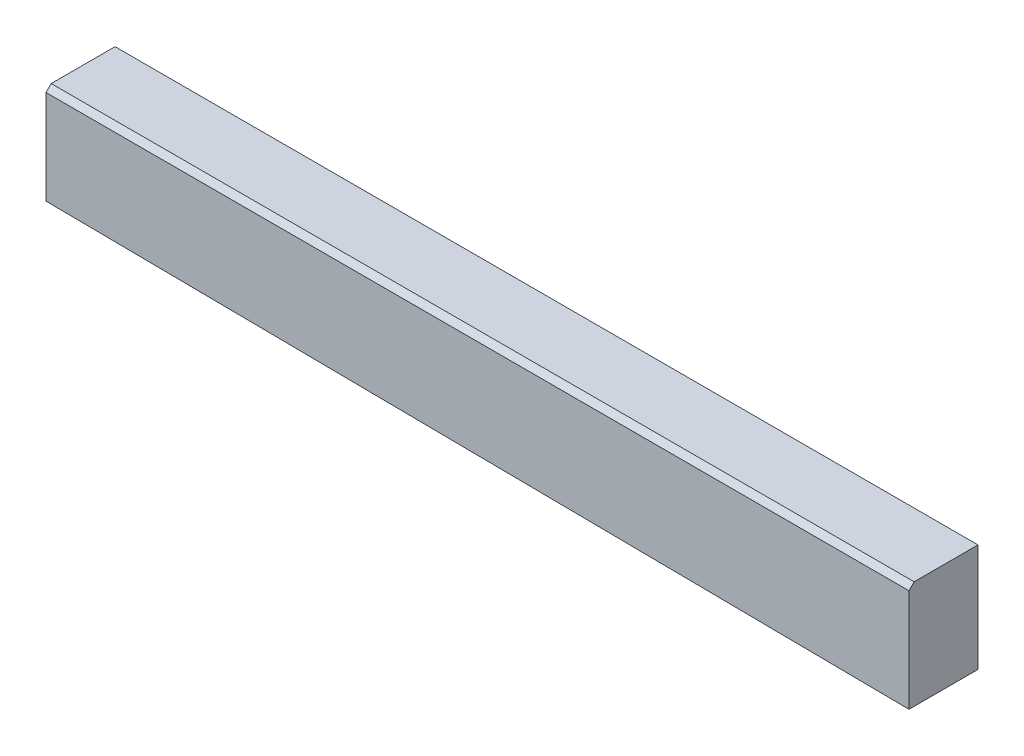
ISO-10303-21;
HEADER;
FILE_DESCRIPTION(('STEP AP214'),'2;1');
FILE_NAME('part.step','',(''),(''),'','','');
FILE_SCHEMA(('AUTOMOTIVE_DESIGN { 1 0 10303 214 1 1 1 1 }'));
ENDSEC;
DATA;
#1=APPLICATION_CONTEXT('core data for automotive mechanical design processes');
#2=APPLICATION_PROTOCOL_DEFINITION('international standard','automotive_design',2000,#1);
#3=PRODUCT_CONTEXT('',#1,'mechanical');
#4=PRODUCT('Part','Part','',(#3));
#5=PRODUCT_RELATED_PRODUCT_CATEGORY('part','',(#4));
#6=PRODUCT_DEFINITION_FORMATION('','',#4);
#7=PRODUCT_DEFINITION_CONTEXT('part definition',#1,'design');
#8=PRODUCT_DEFINITION('design','',#6,#7);
#9=PRODUCT_DEFINITION_SHAPE('','',#8);
#10=(LENGTH_UNIT() NAMED_UNIT(*) SI_UNIT(.MILLI.,.METRE.));
#11=(NAMED_UNIT(*) PLANE_ANGLE_UNIT() SI_UNIT($,.RADIAN.));
#12=(NAMED_UNIT(*) SI_UNIT($,.STERADIAN.) SOLID_ANGLE_UNIT());
#13=UNCERTAINTY_MEASURE_WITH_UNIT(LENGTH_MEASURE(1.E-05),#10,'distance_accuracy_value','');
#14=(GEOMETRIC_REPRESENTATION_CONTEXT(3) GLOBAL_UNCERTAINTY_ASSIGNED_CONTEXT((#13)) GLOBAL_UNIT_ASSIGNED_CONTEXT((#10,
#11,#12)) REPRESENTATION_CONTEXT('',''));
#15=CARTESIAN_POINT('',(0.,0.,0.));
#16=DIRECTION('',(0.,0.,1.));
#17=DIRECTION('',(1.,0.,0.));
#18=AXIS2_PLACEMENT_3D('',#15,#16,#17);
#19=CARTESIAN_POINT('',(0.,24.,4.));
#20=DIRECTION('',(1.,0.,0.));
#21=DIRECTION('',(0.,0.,-1.));
#22=AXIS2_PLACEMENT_3D('',#19,#20,#21);
#23=PLANE('',#22);
#24=DIRECTION('',(0.,0.,-1.));
#25=VECTOR('',#24,1.);
#26=CARTESIAN_POINT('',(0.,24.,4.));
#27=LINE('',#26,#25);
#28=CARTESIAN_POINT('',(0.,24.,3.39999999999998));
#29=VERTEX_POINT('',#28);
#30=CARTESIAN_POINT('',(0.,24.,-4.));
#31=VERTEX_POINT('',#30);
#32=EDGE_CURVE('E106',#29,#31,#27,.T.);
#33=ORIENTED_EDGE('',*,*,#32,.F.);
#34=DIRECTION('',(0.,0.707106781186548,-0.707106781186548));
#35=VECTOR('',#34,1.);
#36=CARTESIAN_POINT('',(0.,23.7,3.69999999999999));
#37=LINE('',#36,#35);
#38=CARTESIAN_POINT('',(0.,23.4,4.));
#39=VERTEX_POINT('',#38);
#40=EDGE_CURVE('E55',#29,#39,#37,.F.);
#41=ORIENTED_EDGE('',*,*,#40,.T.);
#42=DIRECTION('',(0.,-1.,0.));
#43=VECTOR('',#42,1.);
#44=CARTESIAN_POINT('',(0.,24.,4.));
#45=LINE('',#44,#43);
#46=CARTESIAN_POINT('',(0.,11.499983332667,4.));
#47=VERTEX_POINT('',#46);
#48=EDGE_CURVE('E76',#39,#47,#45,.T.);
#49=ORIENTED_EDGE('',*,*,#48,.T.);
#50=DIRECTION('',(0.,0.,-1.));
#51=VECTOR('',#50,1.);
#52=CARTESIAN_POINT('',(0.,11.499983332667,4.));
#53=LINE('',#52,#51);
#54=CARTESIAN_POINT('',(0.,11.499983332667,-4.));
#55=VERTEX_POINT('',#54);
#56=EDGE_CURVE('E79',#47,#55,#53,.T.);
#57=ORIENTED_EDGE('',*,*,#56,.T.);
#58=DIRECTION('',(0.,-1.,0.));
#59=VECTOR('',#58,1.);
#60=CARTESIAN_POINT('',(0.,24.,-4.));
#61=LINE('',#60,#59);
#62=EDGE_CURVE('E98',#31,#55,#61,.T.);
#63=ORIENTED_EDGE('',*,*,#62,.F.);
#64=EDGE_LOOP('',(#33,#41,#49,#57,#63));
#65=FACE_BOUND('',#64,.T.);
#66=ADVANCED_FACE('F33',(#65),#23,.T.);
#67=CARTESIAN_POINT('',(-100.,24.,4.));
#68=DIRECTION('',(0.,1.,0.));
#69=DIRECTION('',(0.,0.,1.));
#70=AXIS2_PLACEMENT_3D('',#67,#68,#69);
#71=PLANE('',#70);
#72=DIRECTION('',(0.,0.,-1.));
#73=VECTOR('',#72,1.);
#74=CARTESIAN_POINT('',(-100.,24.,4.));
#75=LINE('',#74,#73);
#76=CARTESIAN_POINT('',(-100.,24.,3.39999999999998));
#77=VERTEX_POINT('',#76);
#78=CARTESIAN_POINT('',(-100.,24.,-4.));
#79=VERTEX_POINT('',#78);
#80=EDGE_CURVE('E109',#77,#79,#75,.T.);
#81=ORIENTED_EDGE('',*,*,#80,.F.);
#82=DIRECTION('',(1.,0.,0.));
#83=VECTOR('',#82,1.);
#84=CARTESIAN_POINT('',(-100.,24.,3.39999999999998));
#85=LINE('',#84,#83);
#86=EDGE_CURVE('E108',#77,#29,#85,.T.);
#87=ORIENTED_EDGE('',*,*,#86,.T.);
#88=ORIENTED_EDGE('',*,*,#32,.T.);
#89=DIRECTION('',(1.,0.,0.));
#90=VECTOR('',#89,1.);
#91=CARTESIAN_POINT('',(-100.,24.,-4.));
#92=LINE('',#91,#90);
#93=EDGE_CURVE('E83',#79,#31,#92,.T.);
#94=ORIENTED_EDGE('',*,*,#93,.F.);
#95=EDGE_LOOP('',(#81,#87,#88,#94));
#96=FACE_BOUND('',#95,.T.);
#97=ADVANCED_FACE('F117',(#96),#71,.T.);
#98=CARTESIAN_POINT('',(-100.,12.500016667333,4.));
#99=DIRECTION('',(-1.,0.,0.));
#100=DIRECTION('',(0.,0.,1.));
#101=AXIS2_PLACEMENT_3D('',#98,#99,#100);
#102=PLANE('',#101);
#103=DIRECTION('',(0.,1.,0.));
#104=VECTOR('',#103,1.);
#105=CARTESIAN_POINT('',(-100.,12.500016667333,4.));
#106=LINE('',#105,#104);
#107=CARTESIAN_POINT('',(-100.,12.500016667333,4.));
#108=VERTEX_POINT('',#107);
#109=CARTESIAN_POINT('',(-100.,23.4,4.));
#110=VERTEX_POINT('',#109);
#111=EDGE_CURVE('E92',#108,#110,#106,.T.);
#112=ORIENTED_EDGE('',*,*,#111,.T.);
#113=DIRECTION('',(0.,-0.707106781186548,0.707106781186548));
#114=VECTOR('',#113,1.);
#115=CARTESIAN_POINT('',(-100.,17.9500083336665,9.44999166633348));
#116=LINE('',#115,#114);
#117=EDGE_CURVE('E11',#110,#77,#116,.F.);
#118=ORIENTED_EDGE('',*,*,#117,.T.);
#119=ORIENTED_EDGE('',*,*,#80,.T.);
#120=DIRECTION('',(0.,1.,0.));
#121=VECTOR('',#120,1.);
#122=CARTESIAN_POINT('',(-100.,12.500016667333,-4.));
#123=LINE('',#122,#121);
#124=CARTESIAN_POINT('',(-100.,12.500016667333,-4.));
#125=VERTEX_POINT('',#124);
#126=EDGE_CURVE('E101',#125,#79,#123,.T.);
#127=ORIENTED_EDGE('',*,*,#126,.F.);
#128=DIRECTION('',(0.,0.,-1.));
#129=VECTOR('',#128,1.);
#130=CARTESIAN_POINT('',(-100.,12.500016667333,4.));
#131=LINE('',#130,#129);
#132=EDGE_CURVE('E91',#108,#125,#131,.T.);
#133=ORIENTED_EDGE('',*,*,#132,.F.);
#134=EDGE_LOOP('',(#112,#118,#119,#127,#133));
#135=FACE_BOUND('',#134,.T.);
#136=ADVANCED_FACE('F125',(#135),#102,.T.);
#137=CARTESIAN_POINT('',(0.,11.499983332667,4.));
#138=DIRECTION('',(-0.00999983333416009,-0.999950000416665,0.));
#139=DIRECTION('',(0.999950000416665,-0.00999983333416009,0.));
#140=AXIS2_PLACEMENT_3D('',#137,#138,#139);
#141=PLANE('',#140);
#142=DIRECTION('',(-0.999950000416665,0.00999983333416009,0.));
#143=VECTOR('',#142,1.);
#144=CARTESIAN_POINT('',(0.,11.499983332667,-4.));
#145=LINE('',#144,#143);
#146=EDGE_CURVE('E89',#55,#125,#145,.T.);
#147=ORIENTED_EDGE('',*,*,#146,.F.);
#148=ORIENTED_EDGE('',*,*,#56,.F.);
#149=DIRECTION('',(-0.999950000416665,0.00999983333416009,0.));
#150=VECTOR('',#149,1.);
#151=CARTESIAN_POINT('',(0.,11.499983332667,4.));
#152=LINE('',#151,#150);
#153=EDGE_CURVE('E82',#47,#108,#152,.T.);
#154=ORIENTED_EDGE('',*,*,#153,.T.);
#155=ORIENTED_EDGE('',*,*,#132,.T.);
#156=EDGE_LOOP('',(#147,#148,#154,#155));
#157=FACE_BOUND('',#156,.T.);
#158=ADVANCED_FACE('F87',(#157),#141,.T.);
#159=CARTESIAN_POINT('',(0.,24.,4.));
#160=DIRECTION('',(0.,0.,1.));
#161=DIRECTION('',(1.,0.,0.));
#162=AXIS2_PLACEMENT_3D('',#159,#160,#161);
#163=PLANE('',#162);
#164=ORIENTED_EDGE('',*,*,#48,.F.);
#165=DIRECTION('',(-1.,0.,0.));
#166=VECTOR('',#165,1.);
#167=CARTESIAN_POINT('',(0.,23.4,4.));
#168=LINE('',#167,#166);
#169=EDGE_CURVE('E41',#39,#110,#168,.T.);
#170=ORIENTED_EDGE('',*,*,#169,.T.);
#171=ORIENTED_EDGE('',*,*,#111,.F.);
#172=ORIENTED_EDGE('',*,*,#153,.F.);
#173=EDGE_LOOP('',(#164,#170,#171,#172));
#174=FACE_BOUND('',#173,.T.);
#175=ADVANCED_FACE('F94',(#174),#163,.T.);
#176=CARTESIAN_POINT('',(0.,24.,-4.));
#177=DIRECTION('',(0.,0.,1.));
#178=DIRECTION('',(1.,0.,0.));
#179=AXIS2_PLACEMENT_3D('',#176,#177,#178);
#180=PLANE('',#179);
#181=ORIENTED_EDGE('',*,*,#62,.T.);
#182=ORIENTED_EDGE('',*,*,#146,.T.);
#183=ORIENTED_EDGE('',*,*,#126,.T.);
#184=ORIENTED_EDGE('',*,*,#93,.T.);
#185=EDGE_LOOP('',(#181,#182,#183,#184));
#186=FACE_BOUND('',#185,.T.);
#187=ADVANCED_FACE('F122',(#186),#180,.F.);
#188=CARTESIAN_POINT('',(-100.,24.,3.39999999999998));
#189=DIRECTION('',(0.,-0.707106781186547,-0.707106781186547));
#190=DIRECTION('',(0.,0.707106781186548,-0.707106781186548));
#191=AXIS2_PLACEMENT_3D('',#188,#189,#190);
#192=PLANE('',#191);
#193=ORIENTED_EDGE('',*,*,#117,.F.);
#194=ORIENTED_EDGE('',*,*,#169,.F.);
#195=ORIENTED_EDGE('',*,*,#40,.F.);
#196=ORIENTED_EDGE('',*,*,#86,.F.);
#197=EDGE_LOOP('',(#193,#194,#195,#196));
#198=FACE_BOUND('',#197,.T.);
#199=ADVANCED_FACE('F35',(#198),#192,.F.);
#200=CLOSED_SHELL('',(#66,#97,#136,#158,#175,#187,#199));
#201=MANIFOLD_SOLID_BREP('B2',#200);
#202=ADVANCED_BREP_SHAPE_REPRESENTATION('',(#18,#201),#14);
#203=SHAPE_DEFINITION_REPRESENTATION(#9,#202);
ENDSEC;
END-ISO-10303-21;
